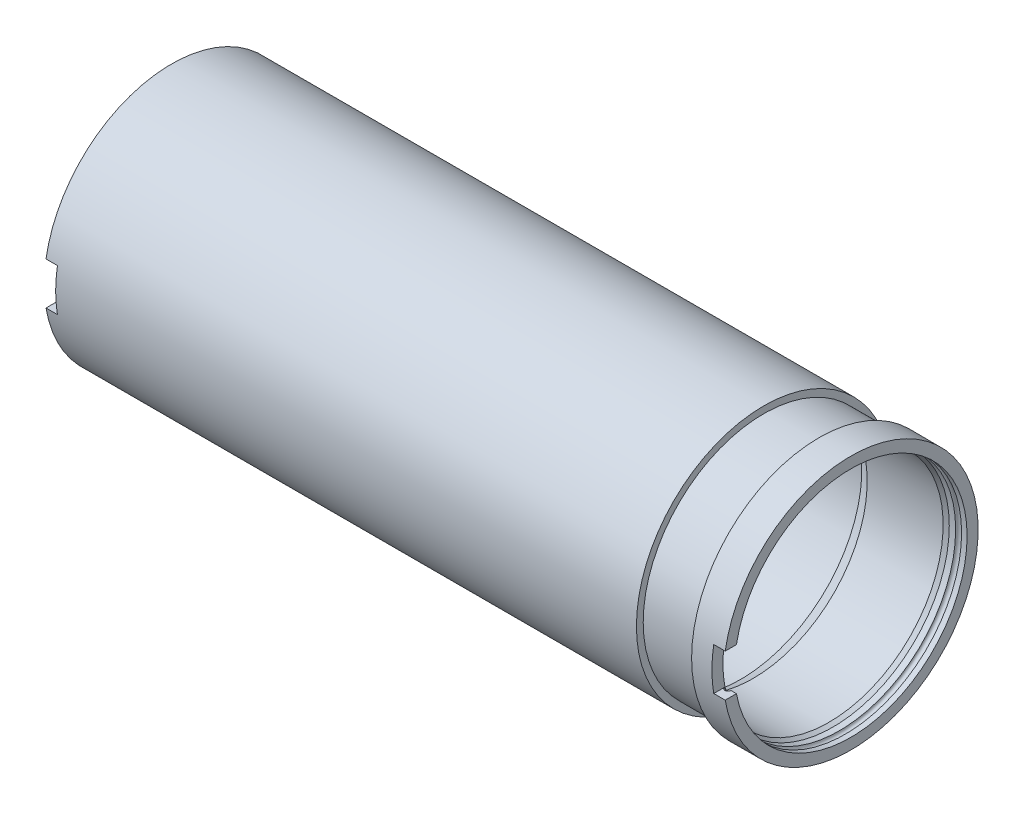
ISO-10303-21;
HEADER;
FILE_DESCRIPTION(('STEP AP214'),'2;1');
FILE_NAME('part.step','',(''),(''),'','','');
FILE_SCHEMA(('AUTOMOTIVE_DESIGN { 1 0 10303 214 1 1 1 1 }'));
ENDSEC;
DATA;
#1=APPLICATION_CONTEXT('core data for automotive mechanical design processes');
#2=APPLICATION_PROTOCOL_DEFINITION('international standard','automotive_design',2000,#1);
#3=PRODUCT_CONTEXT('',#1,'mechanical');
#4=PRODUCT('Part','Part','',(#3));
#5=PRODUCT_RELATED_PRODUCT_CATEGORY('part','',(#4));
#6=PRODUCT_DEFINITION_FORMATION('','',#4);
#7=PRODUCT_DEFINITION_CONTEXT('part definition',#1,'design');
#8=PRODUCT_DEFINITION('design','',#6,#7);
#9=PRODUCT_DEFINITION_SHAPE('','',#8);
#10=(LENGTH_UNIT() NAMED_UNIT(*) SI_UNIT(.MILLI.,.METRE.));
#11=(NAMED_UNIT(*) PLANE_ANGLE_UNIT() SI_UNIT($,.RADIAN.));
#12=(NAMED_UNIT(*) SI_UNIT($,.STERADIAN.) SOLID_ANGLE_UNIT());
#13=UNCERTAINTY_MEASURE_WITH_UNIT(LENGTH_MEASURE(1.E-05),#10,'distance_accuracy_value','');
#14=(GEOMETRIC_REPRESENTATION_CONTEXT(3) GLOBAL_UNCERTAINTY_ASSIGNED_CONTEXT((#13)) GLOBAL_UNIT_ASSIGNED_CONTEXT((#10,
#11,#12)) REPRESENTATION_CONTEXT('',''));
#15=CARTESIAN_POINT('',(0.,0.,0.));
#16=DIRECTION('',(0.,0.,1.));
#17=DIRECTION('',(1.,0.,0.));
#18=AXIS2_PLACEMENT_3D('',#15,#16,#17);
#19=CARTESIAN_POINT('',(200.66,0.,0.));
#20=DIRECTION('',(-1.,0.,0.));
#21=DIRECTION('',(0.,0.,1.));
#22=AXIS2_PLACEMENT_3D('',#19,#20,#21);
#23=TOROIDAL_SURFACE('',#22,34.798,0.888999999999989);
#24=CARTESIAN_POINT('',(201.549,0.,0.));
#25=DIRECTION('',(-1.,0.,0.));
#26=DIRECTION('',(0.,0.,1.));
#27=AXIS2_PLACEMENT_3D('',#24,#25,#26);
#28=CIRCLE('',#27,34.798);
#29=CARTESIAN_POINT('',(201.549,6.35000000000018,34.2137151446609));
#30=VERTEX_POINT('',#29);
#31=CARTESIAN_POINT('',(201.549,-6.35,34.2137151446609));
#32=VERTEX_POINT('',#31);
#33=EDGE_CURVE('E234',#30,#32,#28,.T.);
#34=ORIENTED_EDGE('',*,*,#33,.F.);
#35=CARTESIAN_POINT('',(200.306927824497,6.35,33.3835579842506));
#36=CARTESIAN_POINT('',(200.351930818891,6.35,33.363736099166));
#37=CARTESIAN_POINT('',(200.398627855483,6.35,33.347677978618));
#38=CARTESIAN_POINT('',(200.494090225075,6.35,33.3236136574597));
#39=CARTESIAN_POINT('',(200.542857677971,6.35,33.3156159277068));
#40=CARTESIAN_POINT('',(200.641035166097,6.35,33.3079444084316));
#41=CARTESIAN_POINT('',(200.690445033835,6.35,33.3082684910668));
#42=CARTESIAN_POINT('',(200.788492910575,6.35,33.3172269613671));
#43=CARTESIAN_POINT('',(200.837131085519,6.35,33.3258595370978));
#44=CARTESIAN_POINT('',(200.932183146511,6.35,33.3511371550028));
#45=CARTESIAN_POINT('',(200.978600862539,6.35,33.3677678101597));
#46=CARTESIAN_POINT('',(201.068019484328,6.35,33.4085241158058));
#47=CARTESIAN_POINT('',(201.111020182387,6.35,33.4326502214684));
#48=CARTESIAN_POINT('',(201.192779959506,6.35,33.4879030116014));
#49=CARTESIAN_POINT('',(201.231500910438,6.35,33.519086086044));
#50=CARTESIAN_POINT('',(201.303260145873,6.35,33.5874176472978));
#51=CARTESIAN_POINT('',(201.336298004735,6.35,33.6245665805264));
#52=CARTESIAN_POINT('',(201.396315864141,6.35,33.7044012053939));
#53=CARTESIAN_POINT('',(201.423191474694,6.35,33.7471653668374));
#54=CARTESIAN_POINT('',(201.469515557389,6.35,33.836542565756));
#55=CARTESIAN_POINT('',(201.488963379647,6.35,33.883155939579));
#56=CARTESIAN_POINT('',(201.520197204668,6.35,33.9797216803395));
#57=CARTESIAN_POINT('',(201.531853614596,6.35,34.029715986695));
#58=CARTESIAN_POINT('',(201.546696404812,6.35,34.1309474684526));
#59=CARTESIAN_POINT('',(201.549882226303,6.35,34.1821847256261));
#60=CARTESIAN_POINT('',(201.547688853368,6.35,34.2849669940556));
#61=CARTESIAN_POINT('',(201.542227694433,6.35,34.3365102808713));
#62=CARTESIAN_POINT('',(201.522721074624,6.35,34.4379480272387));
#63=CARTESIAN_POINT('',(201.508675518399,6.35,34.4878424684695));
#64=CARTESIAN_POINT('',(201.472381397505,6.35,34.5844894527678));
#65=CARTESIAN_POINT('',(201.450142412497,6.35,34.631245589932));
#66=CARTESIAN_POINT('',(201.398045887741,6.35,34.7203035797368));
#67=CARTESIAN_POINT('',(201.368188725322,6.35,34.7626056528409));
#68=CARTESIAN_POINT('',(201.302041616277,6.35,34.8410382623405));
#69=CARTESIAN_POINT('',(201.26582668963,6.35,34.8772320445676));
#70=CARTESIAN_POINT('',(201.187748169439,6.35,34.9429058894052));
#71=CARTESIAN_POINT('',(201.145885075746,6.35,34.9723865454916));
#72=CARTESIAN_POINT('',(201.058414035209,6.35,35.0232981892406));
#73=CARTESIAN_POINT('',(201.012876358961,6.35,35.0448499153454));
#74=CARTESIAN_POINT('',(200.918794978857,6.35,35.0798798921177));
#75=CARTESIAN_POINT('',(200.870251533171,6.35,35.0933588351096));
#76=CARTESIAN_POINT('',(200.772256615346,6.35,35.1116874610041));
#77=CARTESIAN_POINT('',(200.722826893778,6.35,35.1166535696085));
#78=CARTESIAN_POINT('',(200.623840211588,6.35,35.1181620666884));
#79=CARTESIAN_POINT('',(200.57428325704,6.35,35.1147048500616));
#80=CARTESIAN_POINT('',(200.476755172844,6.35,35.0995212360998));
#81=CARTESIAN_POINT('',(200.428776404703,6.35,35.0878438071));
#82=CARTESIAN_POINT('',(200.335448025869,6.35,35.056632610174));
#83=CARTESIAN_POINT('',(200.290098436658,6.35,35.0370987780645));
#84=CARTESIAN_POINT('',(200.203095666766,6.35,34.9906667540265));
#85=CARTESIAN_POINT('',(200.161458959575,6.35,34.9637377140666));
#86=CARTESIAN_POINT('',(200.083225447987,6.35,34.9033529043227));
#87=CARTESIAN_POINT('',(200.046628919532,6.35,34.869896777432));
#88=CARTESIAN_POINT('',(199.979013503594,6.35,34.7969677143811));
#89=CARTESIAN_POINT('',(199.948070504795,6.35,34.7574244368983));
#90=CARTESIAN_POINT('',(199.893139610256,6.35,34.6737718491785));
#91=CARTESIAN_POINT('',(199.869152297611,6.35,34.6296621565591));
#92=CARTESIAN_POINT('',(199.828415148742,6.35,34.537379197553));
#93=CARTESIAN_POINT('',(199.811786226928,6.35,34.4891525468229));
#94=CARTESIAN_POINT('',(199.786746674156,6.35,34.390610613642));
#95=CARTESIAN_POINT('',(199.778336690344,6.35,34.3402951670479));
#96=CARTESIAN_POINT('',(199.76988823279,6.35,34.2383203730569));
#97=CARTESIAN_POINT('',(199.769957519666,6.35,34.1866520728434));
#98=CARTESIAN_POINT('',(199.778731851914,6.35,34.0840542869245));
#99=CARTESIAN_POINT('',(199.78743691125,6.35,34.0331248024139));
#100=CARTESIAN_POINT('',(199.813307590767,6.35,33.9332529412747));
#101=CARTESIAN_POINT('',(199.83050520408,6.35,33.8843188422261));
#102=CARTESIAN_POINT('',(199.872934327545,6.35,33.7900486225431));
#103=CARTESIAN_POINT('',(199.898167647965,6.35,33.7447133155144));
#104=CARTESIAN_POINT('',(199.955793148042,6.35,33.6592899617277));
#105=CARTESIAN_POINT('',(199.988136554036,6.35,33.6191689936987));
#106=CARTESIAN_POINT('',(200.059174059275,6.35,33.5450727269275));
#107=CARTESIAN_POINT('',(200.097859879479,6.35,33.5110895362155));
#108=CARTESIAN_POINT('',(200.165232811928,6.35,33.4615080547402));
#109=CARTESIAN_POINT('',(200.192356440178,6.35,33.4437477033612));
#110=CARTESIAN_POINT('',(200.248384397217,6.35,33.4113000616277));
#111=CARTESIAN_POINT('',(200.277288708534,6.35,33.3966127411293));
#112=CARTESIAN_POINT('',(200.306927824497,6.35,33.3835579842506));
#113=B_SPLINE_CURVE_WITH_KNOTS('',3,(#35,#36,#37,#38,#39,#40,#41,#42,#43,#44,#45,#46,#47,#48,
#49,#50,#51,#52,#53,#54,#55,#56,#57,#58,#59,#60,#61,#62,#63,#64,#65,#66,#67,#68,#69,#70,#71,#72,
#73,#74,#75,#76,#77,#78,#79,#80,#81,#82,#83,#84,#85,#86,#87,#88,#89,#90,#91,#92,#93,#94,#95,#96,
#97,#98,#99,#100,#101,#102,#103,#104,#105,#106,#107,#108,#109,#110,#111,#112),.UNSPECIFIED.,.T.,
.F.,(4,2,2,2,2,2,2,2,2,2,2,2,2,2,2,2,2,2,2,2,2,2,2,2,2,2,2,2,2,2,2,2,2,2,2,2,2,2,4),(0.,
0.147407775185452,0.294970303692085,0.442495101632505,0.589987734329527,0.737216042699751,
0.88445329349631,1.03291143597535,1.18138069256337,1.33220471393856,1.48304192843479,
1.63632938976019,1.7896269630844,1.9443863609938,2.09914747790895,2.25372822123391,
2.4083013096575,2.56116000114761,2.71400517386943,2.86441577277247,3.01481347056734,
3.16313734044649,3.31145425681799,3.45889503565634,3.60633701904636,3.75440363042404,
3.90247834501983,4.05241425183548,4.20236272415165,4.35469114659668,4.50703156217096,
4.66130822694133,4.81558514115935,4.97044773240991,5.12534523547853,5.27921160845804,
5.4328787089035,5.52996289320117,5.62704612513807),.UNSPECIFIED.);
#114=CARTESIAN_POINT('',(199.771,6.35,34.2137151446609));
#115=VERTEX_POINT('',#114);
#116=EDGE_CURVE('E236',#30,#115,#113,.T.);
#117=ORIENTED_EDGE('',*,*,#116,.T.);
#118=CARTESIAN_POINT('',(199.771,0.,0.));
#119=DIRECTION('',(-1.,0.,0.));
#120=DIRECTION('',(0.,0.,1.));
#121=AXIS2_PLACEMENT_3D('',#118,#119,#120);
#122=CIRCLE('',#121,34.798);
#123=CARTESIAN_POINT('',(199.771,-6.35,34.2137151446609));
#124=VERTEX_POINT('',#123);
#125=EDGE_CURVE('E297',#115,#124,#122,.T.);
#126=ORIENTED_EDGE('',*,*,#125,.T.);
#127=CARTESIAN_POINT('',(200.306927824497,-6.35,33.3835579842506));
#128=CARTESIAN_POINT('',(200.26108380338,-6.35,33.4037553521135));
#129=CARTESIAN_POINT('',(200.216930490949,-6.35,33.4278891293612));
#130=CARTESIAN_POINT('',(200.133290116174,-6.35,33.4832810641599));
#131=CARTESIAN_POINT('',(200.093809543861,-6.35,33.5145489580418));
#132=CARTESIAN_POINT('',(200.020679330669,-6.35,33.5832090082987));
#133=CARTESIAN_POINT('',(199.987022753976,-6.35,33.6205937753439));
#134=CARTESIAN_POINT('',(199.926380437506,-6.35,33.7004092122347));
#135=CARTESIAN_POINT('',(199.899393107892,-6.35,33.7428386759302));
#136=CARTESIAN_POINT('',(199.852465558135,-6.35,33.8321179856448));
#137=CARTESIAN_POINT('',(199.83261885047,-6.35,33.8790169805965));
#138=CARTESIAN_POINT('',(199.800957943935,-6.35,33.9754546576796));
#139=CARTESIAN_POINT('',(199.789144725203,-6.35,34.0249936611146));
#140=CARTESIAN_POINT('',(199.773743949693,-6.35,34.1260342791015));
#141=CARTESIAN_POINT('',(199.770271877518,-6.35,34.1775535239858));
#142=CARTESIAN_POINT('',(199.771982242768,-6.35,34.2804496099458));
#143=CARTESIAN_POINT('',(199.777165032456,-6.35,34.3318264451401));
#144=CARTESIAN_POINT('',(199.796101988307,-6.35,34.4332213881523));
#145=CARTESIAN_POINT('',(199.809895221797,-6.35,34.4832322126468));
#146=CARTESIAN_POINT('',(199.845734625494,-6.35,34.5802058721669));
#147=CARTESIAN_POINT('',(199.867780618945,-6.35,34.6271687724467));
#148=CARTESIAN_POINT('',(199.919376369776,-6.35,34.7163764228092));
#149=CARTESIAN_POINT('',(199.948877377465,-6.35,34.758649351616));
#150=CARTESIAN_POINT('',(200.014652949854,-6.35,34.837550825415));
#151=CARTESIAN_POINT('',(200.050927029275,-6.35,34.8741797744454));
#152=CARTESIAN_POINT('',(200.128671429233,-6.35,34.9401868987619));
#153=CARTESIAN_POINT('',(200.170060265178,-6.35,34.9696610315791));
#154=CARTESIAN_POINT('',(200.257262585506,-6.35,35.021111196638));
#155=CARTESIAN_POINT('',(200.303075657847,-6.35,35.0430879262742));
#156=CARTESIAN_POINT('',(200.397048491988,-6.35,35.0785638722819));
#157=CARTESIAN_POINT('',(200.44515990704,-6.35,35.0921912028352));
#158=CARTESIAN_POINT('',(200.54299736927,-6.35,35.1110790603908));
#159=CARTESIAN_POINT('',(200.59272330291,-6.35,35.1163401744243));
#160=CARTESIAN_POINT('',(200.69182007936,-6.35,35.1183194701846));
#161=CARTESIAN_POINT('',(200.741189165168,-6.35,35.1151268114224));
#162=CARTESIAN_POINT('',(200.838686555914,-6.35,35.100487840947));
#163=CARTESIAN_POINT('',(200.886814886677,-6.35,35.089041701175));
#164=CARTESIAN_POINT('',(200.980424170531,-6.35,35.0582652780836));
#165=CARTESIAN_POINT('',(201.025907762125,-6.35,35.0389430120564));
#166=CARTESIAN_POINT('',(201.113024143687,-6.35,34.9930004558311));
#167=CARTESIAN_POINT('',(201.154656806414,-6.35,34.9663799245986));
#168=CARTESIAN_POINT('',(201.233292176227,-6.35,34.9063661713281));
#169=CARTESIAN_POINT('',(201.270251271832,-6.35,34.8729158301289));
#170=CARTESIAN_POINT('',(201.338130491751,-6.35,34.8003668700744));
#171=CARTESIAN_POINT('',(201.369050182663,-6.35,34.7612678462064));
#172=CARTESIAN_POINT('',(201.424468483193,-6.35,34.6779101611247));
#173=CARTESIAN_POINT('',(201.44886427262,-6.35,34.6335831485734));
#174=CARTESIAN_POINT('',(201.489995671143,-6.35,34.5415076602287));
#175=CARTESIAN_POINT('',(201.50673063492,-6.35,34.4937588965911));
#176=CARTESIAN_POINT('',(201.532317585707,-6.35,34.3954198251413));
#177=CARTESIAN_POINT('',(201.541046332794,-6.35,34.3447974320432));
#178=CARTESIAN_POINT('',(201.549965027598,-6.35,34.2428050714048));
#179=CARTESIAN_POINT('',(201.550154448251,-6.35,34.1914350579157));
#180=CARTESIAN_POINT('',(201.541955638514,-6.35,34.0889174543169));
#181=CARTESIAN_POINT('',(201.533490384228,-6.35,34.0377760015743));
#182=CARTESIAN_POINT('',(201.508083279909,-6.35,33.9376416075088));
#183=CARTESIAN_POINT('',(201.491141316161,-6.35,33.8886486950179));
#184=CARTESIAN_POINT('',(201.449253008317,-6.35,33.794295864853));
#185=CARTESIAN_POINT('',(201.42431838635,-6.35,33.7489307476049));
#186=CARTESIAN_POINT('',(201.36710048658,-6.35,33.6630964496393));
#187=CARTESIAN_POINT('',(201.334817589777,-6.35,33.622627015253));
#188=CARTESIAN_POINT('',(201.26421054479,-6.35,33.5482611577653));
#189=CARTESIAN_POINT('',(201.225962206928,-6.35,33.5142927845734));
#190=CARTESIAN_POINT('',(201.144222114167,-6.35,33.4533953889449));
#191=CARTESIAN_POINT('',(201.100731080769,-6.35,33.4264653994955));
#192=CARTESIAN_POINT('',(201.01054312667,-6.35,33.3808984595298));
#193=CARTESIAN_POINT('',(200.963914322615,-6.35,33.3621266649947));
#194=CARTESIAN_POINT('',(200.868125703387,-6.35,33.3328034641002));
#195=CARTESIAN_POINT('',(200.81896547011,-6.35,33.322253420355));
#196=CARTESIAN_POINT('',(200.720263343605,-6.35,33.3098072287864));
#197=CARTESIAN_POINT('',(200.670736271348,-6.35,33.3077927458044));
#198=CARTESIAN_POINT('',(200.572097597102,-6.35,33.3121619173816));
#199=CARTESIAN_POINT('',(200.522985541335,-6.35,33.3185347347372));
#200=CARTESIAN_POINT('',(200.445987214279,-6.35,33.3352264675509));
#201=CARTESIAN_POINT('',(200.417507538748,-6.35,33.3429278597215));
#202=CARTESIAN_POINT('',(200.361466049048,-6.35,33.3611511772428));
#203=CARTESIAN_POINT('',(200.333904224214,-6.35,33.3716730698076));
#204=CARTESIAN_POINT('',(200.306927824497,-6.35,33.3835579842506));
#205=B_SPLINE_CURVE_WITH_KNOTS('',3,(#127,#128,#129,#130,#131,#132,#133,#134,#135,#136,#137,
#138,#139,#140,#141,#142,#143,#144,#145,#146,#147,#148,#149,#150,#151,#152,#153,#154,#155,#156,
#157,#158,#159,#160,#161,#162,#163,#164,#165,#166,#167,#168,#169,#170,#171,#172,#173,#174,#175,
#176,#177,#178,#179,#180,#181,#182,#183,#184,#185,#186,#187,#188,#189,#190,#191,#192,#193,#194,
#195,#196,#197,#198,#199,#200,#201,#202,#203,#204),.UNSPECIFIED.,.T.,.F.,(4,2,2,2,2,2,2,2,2,2,2,
2,2,2,2,2,2,2,2,2,2,2,2,2,2,2,2,2,2,2,2,2,2,2,2,2,2,2,4),(0.,0.150178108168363,0.30056241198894,
0.450766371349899,0.600934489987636,0.753003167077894,0.90509039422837,1.05927145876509,
1.21345879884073,1.36835085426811,1.52323959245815,1.67714057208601,1.83103052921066,
1.9827257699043,2.1344068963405,2.28369816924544,2.43297896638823,2.58069162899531,
2.72840121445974,2.87596081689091,3.02352529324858,3.17237853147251,3.32124244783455,
3.47233014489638,3.62343056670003,3.77681965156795,3.93021820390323,4.08499394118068,
4.23977175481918,4.39432360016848,4.54886743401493,4.70158700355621,4.85428557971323,
5.00435420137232,5.15444768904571,5.30245336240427,5.45026798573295,5.5386396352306,
5.62701025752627),.UNSPECIFIED.);
#206=EDGE_CURVE('E128',#124,#32,#205,.T.);
#207=ORIENTED_EDGE('',*,*,#206,.T.);
#208=EDGE_LOOP('',(#34,#117,#126,#207));
#209=FACE_BOUND('',#208,.T.);
#210=ADVANCED_FACE('F39',(#209),#23,.F.);
#211=CARTESIAN_POINT('',(-166.103267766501,0.,0.));
#212=DIRECTION('',(-1.,0.,0.));
#213=DIRECTION('',(0.,0.,1.));
#214=AXIS2_PLACEMENT_3D('',#211,#212,#213);
#215=CYLINDRICAL_SURFACE('',#214,34.798);
#216=DIRECTION('',(-1.,0.,0.));
#217=VECTOR('',#216,1.);
#218=CARTESIAN_POINT('',(-166.103267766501,6.35000000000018,34.2137151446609));
#219=LINE('',#218,#217);
#220=CARTESIAN_POINT('',(203.2,6.35,34.2137151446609));
#221=VERTEX_POINT('',#220);
#222=EDGE_CURVE('E335',#30,#221,#219,.F.);
#223=ORIENTED_EDGE('',*,*,#222,.F.);
#224=ORIENTED_EDGE('',*,*,#33,.T.);
#225=DIRECTION('',(-1.,0.,0.));
#226=VECTOR('',#225,1.);
#227=CARTESIAN_POINT('',(-166.103267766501,-6.35,34.2137151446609));
#228=LINE('',#227,#226);
#229=CARTESIAN_POINT('',(203.2,-6.35,34.2137151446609));
#230=VERTEX_POINT('',#229);
#231=EDGE_CURVE('E121',#230,#32,#228,.T.);
#232=ORIENTED_EDGE('',*,*,#231,.F.);
#233=CARTESIAN_POINT('',(203.2,0.,0.));
#234=DIRECTION('',(-1.,0.,0.));
#235=DIRECTION('',(0.,0.,1.));
#236=AXIS2_PLACEMENT_3D('',#233,#234,#235);
#237=CIRCLE('',#236,34.798);
#238=EDGE_CURVE('E241',#221,#230,#237,.T.);
#239=ORIENTED_EDGE('',*,*,#238,.F.);
#240=EDGE_LOOP('',(#223,#224,#232,#239));
#241=FACE_BOUND('',#240,.T.);
#242=ADVANCED_FACE('F180',(#241),#215,.F.);
#243=CARTESIAN_POINT('',(203.2,0.,0.));
#244=DIRECTION('',(-1.,0.,0.));
#245=DIRECTION('',(0.,0.,1.));
#246=AXIS2_PLACEMENT_3D('',#243,#244,#245);
#247=PLANE('',#246);
#248=DIRECTION('',(0.,0.,-1.));
#249=VECTOR('',#248,1.);
#250=CARTESIAN_POINT('',(203.2,6.35,38.1));
#251=LINE('',#250,#249);
#252=CARTESIAN_POINT('',(203.2,6.35,37.5671066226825));
#253=VERTEX_POINT('',#252);
#254=EDGE_CURVE('E122',#253,#221,#251,.T.);
#255=ORIENTED_EDGE('',*,*,#254,.T.);
#256=ORIENTED_EDGE('',*,*,#238,.T.);
#257=DIRECTION('',(0.,0.,-1.));
#258=VECTOR('',#257,1.);
#259=CARTESIAN_POINT('',(203.2,-6.35,38.1));
#260=LINE('',#259,#258);
#261=CARTESIAN_POINT('',(203.2,-6.35,37.5671066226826));
#262=VERTEX_POINT('',#261);
#263=EDGE_CURVE('E130',#262,#230,#260,.T.);
#264=ORIENTED_EDGE('',*,*,#263,.F.);
#265=CARTESIAN_POINT('',(203.2,0.,0.));
#266=DIRECTION('',(-1.,0.,0.));
#267=DIRECTION('',(0.,0.,1.));
#268=AXIS2_PLACEMENT_3D('',#265,#266,#267);
#269=CIRCLE('',#268,38.1);
#270=EDGE_CURVE('E135',#253,#262,#269,.T.);
#271=ORIENTED_EDGE('',*,*,#270,.F.);
#272=EDGE_LOOP('',(#255,#256,#264,#271));
#273=FACE_BOUND('',#272,.T.);
#274=ADVANCED_FACE('F229',(#273),#247,.F.);
#275=CARTESIAN_POINT('',(-166.103267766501,0.,0.));
#276=DIRECTION('',(-1.,0.,0.));
#277=DIRECTION('',(0.,0.,1.));
#278=AXIS2_PLACEMENT_3D('',#275,#276,#277);
#279=CYLINDRICAL_SURFACE('',#278,38.1);
#280=CARTESIAN_POINT('',(193.675,0.,0.));
#281=DIRECTION('',(-1.,0.,0.));
#282=DIRECTION('',(0.,0.,1.));
#283=AXIS2_PLACEMENT_3D('',#280,#281,#282);
#284=CIRCLE('',#283,38.1);
#285=CARTESIAN_POINT('',(193.675,0.,38.1));
#286=VERTEX_POINT('',#285);
#287=EDGE_CURVE('E248',#286,#286,#284,.T.);
#288=ORIENTED_EDGE('',*,*,#287,.F.);
#289=EDGE_LOOP('',(#288));
#290=FACE_BOUND('',#289,.T.);
#291=DIRECTION('',(-1.,0.,0.));
#292=VECTOR('',#291,1.);
#293=CARTESIAN_POINT('',(-166.103267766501,6.35000000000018,37.5671066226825));
#294=LINE('',#293,#292);
#295=CARTESIAN_POINT('',(199.771,6.35,37.5671066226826));
#296=VERTEX_POINT('',#295);
#297=EDGE_CURVE('E11',#253,#296,#294,.T.);
#298=ORIENTED_EDGE('',*,*,#297,.F.);
#299=ORIENTED_EDGE('',*,*,#270,.T.);
#300=DIRECTION('',(-1.,0.,0.));
#301=VECTOR('',#300,1.);
#302=CARTESIAN_POINT('',(-166.103267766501,-6.35,37.5671066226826));
#303=LINE('',#302,#301);
#304=CARTESIAN_POINT('',(199.771,-6.35,37.5671066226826));
#305=VERTEX_POINT('',#304);
#306=EDGE_CURVE('E47',#305,#262,#303,.F.);
#307=ORIENTED_EDGE('',*,*,#306,.F.);
#308=CARTESIAN_POINT('',(199.771,0.,0.));
#309=DIRECTION('',(1.,0.,0.));
#310=DIRECTION('',(0.,0.,-1.));
#311=AXIS2_PLACEMENT_3D('',#308,#309,#310);
#312=CIRCLE('',#311,38.1);
#313=EDGE_CURVE('E114',#296,#305,#312,.T.);
#314=ORIENTED_EDGE('',*,*,#313,.F.);
#315=EDGE_LOOP('',(#298,#299,#307,#314));
#316=FACE_BOUND('',#315,.T.);
#317=ADVANCED_FACE('F133',(#290,#316),#279,.T.);
#318=CARTESIAN_POINT('',(-166.103267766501,0.,0.));
#319=DIRECTION('',(-1.,0.,0.));
#320=DIRECTION('',(0.,0.,1.));
#321=AXIS2_PLACEMENT_3D('',#318,#319,#320);
#322=CYLINDRICAL_SURFACE('',#321,38.1);
#323=CARTESIAN_POINT('',(177.165,0.,0.));
#324=DIRECTION('',(-1.,0.,0.));
#325=DIRECTION('',(0.,0.,1.));
#326=AXIS2_PLACEMENT_3D('',#323,#324,#325);
#327=CIRCLE('',#326,38.1);
#328=CARTESIAN_POINT('',(177.165,0.,38.1));
#329=VERTEX_POINT('',#328);
#330=EDGE_CURVE('E257',#329,#329,#327,.T.);
#331=ORIENTED_EDGE('',*,*,#330,.T.);
#332=EDGE_LOOP('',(#331));
#333=FACE_BOUND('',#332,.T.);
#334=CARTESIAN_POINT('',(3.42899999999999,0.,0.));
#335=DIRECTION('',(-1.,0.,0.));
#336=DIRECTION('',(0.,0.,1.));
#337=AXIS2_PLACEMENT_3D('',#334,#335,#336);
#338=CIRCLE('',#337,38.1);
#339=CARTESIAN_POINT('',(3.42899999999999,6.35,37.5671066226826));
#340=VERTEX_POINT('',#339);
#341=CARTESIAN_POINT('',(3.42899999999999,-6.35,37.5671066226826));
#342=VERTEX_POINT('',#341);
#343=EDGE_CURVE('E319',#340,#342,#338,.F.);
#344=ORIENTED_EDGE('',*,*,#343,.T.);
#345=DIRECTION('',(-1.,0.,0.));
#346=VECTOR('',#345,1.);
#347=CARTESIAN_POINT('',(-166.103267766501,-6.35,37.5671066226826));
#348=LINE('',#347,#346);
#349=CARTESIAN_POINT('',(0.,-6.35,37.5671066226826));
#350=VERTEX_POINT('',#349);
#351=EDGE_CURVE('E309',#342,#350,#348,.T.);
#352=ORIENTED_EDGE('',*,*,#351,.T.);
#353=CARTESIAN_POINT('',(0.,0.,0.));
#354=DIRECTION('',(-1.,0.,0.));
#355=DIRECTION('',(0.,0.,1.));
#356=AXIS2_PLACEMENT_3D('',#353,#354,#355);
#357=CIRCLE('',#356,38.1);
#358=CARTESIAN_POINT('',(0.,6.35,37.5671066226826));
#359=VERTEX_POINT('',#358);
#360=EDGE_CURVE('E260',#359,#350,#357,.T.);
#361=ORIENTED_EDGE('',*,*,#360,.F.);
#362=DIRECTION('',(-1.,0.,0.));
#363=VECTOR('',#362,1.);
#364=CARTESIAN_POINT('',(-166.103267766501,6.35,37.5671066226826));
#365=LINE('',#364,#363);
#366=EDGE_CURVE('E314',#359,#340,#365,.F.);
#367=ORIENTED_EDGE('',*,*,#366,.T.);
#368=EDGE_LOOP('',(#344,#352,#361,#367));
#369=FACE_BOUND('',#368,.T.);
#370=ADVANCED_FACE('F360',(#333,#369),#322,.T.);
#371=CARTESIAN_POINT('',(0.,0.,0.));
#372=DIRECTION('',(1.,0.,0.));
#373=DIRECTION('',(0.,0.,-1.));
#374=AXIS2_PLACEMENT_3D('',#371,#372,#373);
#375=PLANE('',#374);
#376=DIRECTION('',(0.,0.,-1.));
#377=VECTOR('',#376,1.);
#378=CARTESIAN_POINT('',(0.,-6.35,38.1));
#379=LINE('',#378,#377);
#380=CARTESIAN_POINT('',(0.,-6.35,34.2137151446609));
#381=VERTEX_POINT('',#380);
#382=EDGE_CURVE('E321',#350,#381,#379,.T.);
#383=ORIENTED_EDGE('',*,*,#382,.T.);
#384=CARTESIAN_POINT('',(0.,0.,0.));
#385=DIRECTION('',(-1.,0.,0.));
#386=DIRECTION('',(0.,0.,1.));
#387=AXIS2_PLACEMENT_3D('',#384,#385,#386);
#388=CIRCLE('',#387,34.798);
#389=CARTESIAN_POINT('',(0.,6.35,34.2137151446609));
#390=VERTEX_POINT('',#389);
#391=EDGE_CURVE('E263',#390,#381,#388,.T.);
#392=ORIENTED_EDGE('',*,*,#391,.F.);
#393=DIRECTION('',(0.,0.,-1.));
#394=VECTOR('',#393,1.);
#395=CARTESIAN_POINT('',(0.,6.35,38.1));
#396=LINE('',#395,#394);
#397=EDGE_CURVE('E328',#359,#390,#396,.T.);
#398=ORIENTED_EDGE('',*,*,#397,.F.);
#399=ORIENTED_EDGE('',*,*,#360,.T.);
#400=EDGE_LOOP('',(#383,#392,#398,#399));
#401=FACE_BOUND('',#400,.T.);
#402=ADVANCED_FACE('F222',(#401),#375,.F.);
#403=CARTESIAN_POINT('',(-166.103267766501,0.,0.));
#404=DIRECTION('',(-1.,0.,0.));
#405=DIRECTION('',(0.,0.,1.));
#406=AXIS2_PLACEMENT_3D('',#403,#404,#405);
#407=CYLINDRICAL_SURFACE('',#406,34.798);
#408=DIRECTION('',(-1.,0.,0.));
#409=VECTOR('',#408,1.);
#410=CARTESIAN_POINT('',(-166.103267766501,-6.35,34.2137151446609));
#411=LINE('',#410,#409);
#412=CARTESIAN_POINT('',(1.651,-6.35,34.2137151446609));
#413=VERTEX_POINT('',#412);
#414=EDGE_CURVE('E312',#413,#381,#411,.T.);
#415=ORIENTED_EDGE('',*,*,#414,.F.);
#416=CARTESIAN_POINT('',(1.65100000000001,0.,0.));
#417=DIRECTION('',(-1.,0.,0.));
#418=DIRECTION('',(0.,0.,1.));
#419=AXIS2_PLACEMENT_3D('',#416,#417,#418);
#420=CIRCLE('',#419,34.798);
#421=CARTESIAN_POINT('',(1.65099999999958,6.35,34.213715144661));
#422=VERTEX_POINT('',#421);
#423=EDGE_CURVE('E266',#422,#413,#420,.T.);
#424=ORIENTED_EDGE('',*,*,#423,.F.);
#425=DIRECTION('',(-1.,0.,0.));
#426=VECTOR('',#425,1.);
#427=CARTESIAN_POINT('',(-166.103267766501,6.35,34.2137151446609));
#428=LINE('',#427,#426);
#429=EDGE_CURVE('E317',#390,#422,#428,.F.);
#430=ORIENTED_EDGE('',*,*,#429,.F.);
#431=ORIENTED_EDGE('',*,*,#391,.T.);
#432=EDGE_LOOP('',(#415,#424,#430,#431));
#433=FACE_BOUND('',#432,.T.);
#434=ADVANCED_FACE('F212',(#433),#407,.F.);
#435=CARTESIAN_POINT('',(2.54,0.,0.));
#436=DIRECTION('',(-1.,0.,0.));
#437=DIRECTION('',(0.,0.,1.));
#438=AXIS2_PLACEMENT_3D('',#435,#436,#437);
#439=TOROIDAL_SURFACE('',#438,34.798,0.888999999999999);
#440=ORIENTED_EDGE('',*,*,#423,.T.);
#441=CARTESIAN_POINT('',(2.18692782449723,-6.35,33.3835579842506));
#442=CARTESIAN_POINT('',(2.14108380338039,-6.35,33.4037553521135));
#443=CARTESIAN_POINT('',(2.09693049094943,-6.35,33.4278891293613));
#444=CARTESIAN_POINT('',(2.0132901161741,-6.35,33.4832810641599));
#445=CARTESIAN_POINT('',(1.97380954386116,-6.35,33.5145489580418));
#446=CARTESIAN_POINT('',(1.90067933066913,-6.35,33.5832090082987));
#447=CARTESIAN_POINT('',(1.86702275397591,-6.35,33.6205937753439));
#448=CARTESIAN_POINT('',(1.80638043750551,-6.35,33.7004092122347));
#449=CARTESIAN_POINT('',(1.77939310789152,-6.35,33.7428386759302));
#450=CARTESIAN_POINT('',(1.73246555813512,-6.35,33.8321179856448));
#451=CARTESIAN_POINT('',(1.71261885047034,-6.35,33.8790169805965));
#452=CARTESIAN_POINT('',(1.68095794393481,-6.35,33.9754546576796));
#453=CARTESIAN_POINT('',(1.66914472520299,-6.35,34.0249936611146));
#454=CARTESIAN_POINT('',(1.65374394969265,-6.35,34.1260342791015));
#455=CARTESIAN_POINT('',(1.65027187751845,-6.35,34.1775535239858));
#456=CARTESIAN_POINT('',(1.65198224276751,-6.35,34.2804496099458));
#457=CARTESIAN_POINT('',(1.65716503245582,-6.35,34.3318264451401));
#458=CARTESIAN_POINT('',(1.67610198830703,-6.35,34.4332213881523));
#459=CARTESIAN_POINT('',(1.68989522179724,-6.35,34.4832322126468));
#460=CARTESIAN_POINT('',(1.72573462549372,-6.35,34.5802058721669));
#461=CARTESIAN_POINT('',(1.74778061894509,-6.35,34.6271687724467));
#462=CARTESIAN_POINT('',(1.7993763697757,-6.35,34.7163764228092));
#463=CARTESIAN_POINT('',(1.82887737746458,-6.35,34.758649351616));
#464=CARTESIAN_POINT('',(1.89465294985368,-6.35,34.837550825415));
#465=CARTESIAN_POINT('',(1.93092702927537,-6.35,34.8741797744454));
#466=CARTESIAN_POINT('',(2.00867142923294,-6.35,34.940186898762));
#467=CARTESIAN_POINT('',(2.05006026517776,-6.35,34.9696610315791));
#468=CARTESIAN_POINT('',(2.13726258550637,-6.35,35.0211111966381));
#469=CARTESIAN_POINT('',(2.18307565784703,-6.35,35.0430879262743));
#470=CARTESIAN_POINT('',(2.27704849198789,-6.35,35.0785638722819));
#471=CARTESIAN_POINT('',(2.32515990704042,-6.35,35.0921912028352));
#472=CARTESIAN_POINT('',(2.42299736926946,-6.35,35.1110790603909));
#473=CARTESIAN_POINT('',(2.47272330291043,-6.35,35.1163401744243));
#474=CARTESIAN_POINT('',(2.57182007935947,-6.35,35.1183194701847));
#475=CARTESIAN_POINT('',(2.62118916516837,-6.35,35.1151268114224));
#476=CARTESIAN_POINT('',(2.71868655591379,-6.35,35.1004878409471));
#477=CARTESIAN_POINT('',(2.76681488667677,-6.35,35.089041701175));
#478=CARTESIAN_POINT('',(2.86042417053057,-6.35,35.0582652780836));
#479=CARTESIAN_POINT('',(2.90590776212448,-6.35,35.0389430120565));
#480=CARTESIAN_POINT('',(2.99302414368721,-6.35,34.9930004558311));
#481=CARTESIAN_POINT('',(3.03465680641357,-6.35,34.9663799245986));
#482=CARTESIAN_POINT('',(3.11329217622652,-6.35,34.9063661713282));
#483=CARTESIAN_POINT('',(3.15025127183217,-6.35,34.8729158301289));
#484=CARTESIAN_POINT('',(3.21813049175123,-6.35,34.8003668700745));
#485=CARTESIAN_POINT('',(3.24905018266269,-6.35,34.7612678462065));
#486=CARTESIAN_POINT('',(3.30446848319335,-6.35,34.6779101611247));
#487=CARTESIAN_POINT('',(3.32886427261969,-6.35,34.6335831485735));
#488=CARTESIAN_POINT('',(3.3699956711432,-6.35,34.5415076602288));
#489=CARTESIAN_POINT('',(3.38673063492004,-6.35,34.4937588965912));
#490=CARTESIAN_POINT('',(3.41231758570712,-6.35,34.3954198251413));
#491=CARTESIAN_POINT('',(3.42104633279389,-6.35,34.3447974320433));
#492=CARTESIAN_POINT('',(3.42996502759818,-6.35,34.2428050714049));
#493=CARTESIAN_POINT('',(3.43015444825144,-6.35,34.1914350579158));
#494=CARTESIAN_POINT('',(3.42195563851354,-6.35,34.088917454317));
#495=CARTESIAN_POINT('',(3.41349038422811,-6.35,34.0377760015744));
#496=CARTESIAN_POINT('',(3.38808327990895,-6.35,33.9376416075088));
#497=CARTESIAN_POINT('',(3.37114131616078,-6.35,33.8886486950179));
#498=CARTESIAN_POINT('',(3.32925300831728,-6.35,33.794295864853));
#499=CARTESIAN_POINT('',(3.30431838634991,-6.35,33.7489307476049));
#500=CARTESIAN_POINT('',(3.2471004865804,-6.35,33.6630964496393));
#501=CARTESIAN_POINT('',(3.21481758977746,-6.35,33.6226270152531));
#502=CARTESIAN_POINT('',(3.14421054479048,-6.35,33.5482611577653));
#503=CARTESIAN_POINT('',(3.10596220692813,-6.35,33.5142927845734));
#504=CARTESIAN_POINT('',(3.02422211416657,-6.35,33.4533953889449));
#505=CARTESIAN_POINT('',(2.98073108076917,-6.35,33.4264653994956));
#506=CARTESIAN_POINT('',(2.89054312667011,-6.35,33.3808984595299));
#507=CARTESIAN_POINT('',(2.84391432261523,-6.35,33.3621266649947));
#508=CARTESIAN_POINT('',(2.74812570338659,-6.35,33.3328034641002));
#509=CARTESIAN_POINT('',(2.69896547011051,-6.35,33.3222534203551));
#510=CARTESIAN_POINT('',(2.60026334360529,-6.35,33.3098072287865));
#511=CARTESIAN_POINT('',(2.55073627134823,-6.35,33.3077927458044));
#512=CARTESIAN_POINT('',(2.45209759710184,-6.35,33.3121619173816));
#513=CARTESIAN_POINT('',(2.40298554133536,-6.35,33.3185347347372));
#514=CARTESIAN_POINT('',(2.32598721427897,-6.35,33.335226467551));
#515=CARTESIAN_POINT('',(2.29750753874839,-6.35,33.3429278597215));
#516=CARTESIAN_POINT('',(2.24146604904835,-6.35,33.3611511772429));
#517=CARTESIAN_POINT('',(2.21390422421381,-6.35,33.3716730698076));
#518=CARTESIAN_POINT('',(2.18692782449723,-6.35,33.3835579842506));
#519=B_SPLINE_CURVE_WITH_KNOTS('',3,(#441,#442,#443,#444,#445,#446,#447,#448,#449,#450,#451,
#452,#453,#454,#455,#456,#457,#458,#459,#460,#461,#462,#463,#464,#465,#466,#467,#468,#469,#470,
#471,#472,#473,#474,#475,#476,#477,#478,#479,#480,#481,#482,#483,#484,#485,#486,#487,#488,#489,
#490,#491,#492,#493,#494,#495,#496,#497,#498,#499,#500,#501,#502,#503,#504,#505,#506,#507,#508,
#509,#510,#511,#512,#513,#514,#515,#516,#517,#518),.UNSPECIFIED.,.T.,.F.,(4,2,2,2,2,2,2,2,2,2,2,
2,2,2,2,2,2,2,2,2,2,2,2,2,2,2,2,2,2,2,2,2,2,2,2,2,2,2,4),(0.,0.150178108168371,
0.300562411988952,0.450766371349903,0.600934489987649,0.753003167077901,0.905090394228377,
1.0592714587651,1.21345879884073,1.3683508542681,1.52323959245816,1.67714057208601,
1.83103052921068,1.98272576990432,2.13440689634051,2.28369816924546,2.43297896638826,
2.58069162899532,2.72840121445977,2.87596081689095,3.02352529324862,3.17237853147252,
3.32124244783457,3.47233014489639,3.62343056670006,3.77681965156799,3.93021820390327,
4.08499394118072,4.23977175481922,4.39432360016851,4.54886743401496,4.70158700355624,
4.85428557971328,5.00435420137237,5.15444768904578,5.30245336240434,5.45026798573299,
5.53863963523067,5.62701025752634),.UNSPECIFIED.);
#520=CARTESIAN_POINT('',(3.42899999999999,-6.35,34.2137151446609));
#521=VERTEX_POINT('',#520);
#522=EDGE_CURVE('E136',#413,#521,#519,.T.);
#523=ORIENTED_EDGE('',*,*,#522,.T.);
#524=CARTESIAN_POINT('',(3.42899999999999,0.,0.));
#525=DIRECTION('',(-1.,0.,0.));
#526=DIRECTION('',(0.,0.,1.));
#527=AXIS2_PLACEMENT_3D('',#524,#525,#526);
#528=CIRCLE('',#527,34.798);
#529=CARTESIAN_POINT('',(3.42899999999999,6.35,34.2137151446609));
#530=VERTEX_POINT('',#529);
#531=EDGE_CURVE('E269',#530,#521,#528,.T.);
#532=ORIENTED_EDGE('',*,*,#531,.F.);
#533=CARTESIAN_POINT('',(2.18692782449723,6.35,33.3835579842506));
#534=CARTESIAN_POINT('',(2.23193081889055,6.35,33.3637360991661));
#535=CARTESIAN_POINT('',(2.27862785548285,6.35,33.347677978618));
#536=CARTESIAN_POINT('',(2.37409022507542,6.35,33.3236136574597));
#537=CARTESIAN_POINT('',(2.42285767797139,6.35,33.3156159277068));
#538=CARTESIAN_POINT('',(2.52103516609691,6.35,33.3079444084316));
#539=CARTESIAN_POINT('',(2.57044503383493,6.35,33.3082684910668));
#540=CARTESIAN_POINT('',(2.66849291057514,6.35,33.3172269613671));
#541=CARTESIAN_POINT('',(2.71713108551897,6.35,33.3258595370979));
#542=CARTESIAN_POINT('',(2.81218314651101,6.35,33.3511371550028));
#543=CARTESIAN_POINT('',(2.85860086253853,6.35,33.3677678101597));
#544=CARTESIAN_POINT('',(2.94801948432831,6.35,33.4085241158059));
#545=CARTESIAN_POINT('',(2.99102018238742,6.35,33.4326502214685));
#546=CARTESIAN_POINT('',(3.07277995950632,6.35,33.4879030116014));
#547=CARTESIAN_POINT('',(3.11150091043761,6.35,33.5190860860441));
#548=CARTESIAN_POINT('',(3.18326014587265,6.35,33.5874176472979));
#549=CARTESIAN_POINT('',(3.2162980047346,6.35,33.6245665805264));
#550=CARTESIAN_POINT('',(3.2763158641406,6.35,33.7044012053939));
#551=CARTESIAN_POINT('',(3.30319147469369,6.35,33.7471653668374));
#552=CARTESIAN_POINT('',(3.34951555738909,6.35,33.8365425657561));
#553=CARTESIAN_POINT('',(3.36896337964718,6.35,33.8831559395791));
#554=CARTESIAN_POINT('',(3.40019720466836,6.35,33.9797216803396));
#555=CARTESIAN_POINT('',(3.41185361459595,6.35,34.0297159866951));
#556=CARTESIAN_POINT('',(3.42669640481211,6.35,34.1309474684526));
#557=CARTESIAN_POINT('',(3.42988222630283,6.35,34.1821847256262));
#558=CARTESIAN_POINT('',(3.42768885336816,6.35,34.2849669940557));
#559=CARTESIAN_POINT('',(3.42222769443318,6.35,34.3365102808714));
#560=CARTESIAN_POINT('',(3.40272107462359,6.35,34.4379480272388));
#561=CARTESIAN_POINT('',(3.38867551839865,6.35,34.4878424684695));
#562=CARTESIAN_POINT('',(3.35238139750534,6.35,34.5844894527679));
#563=CARTESIAN_POINT('',(3.3301424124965,6.35,34.631245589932));
#564=CARTESIAN_POINT('',(3.27804588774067,6.35,34.7203035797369));
#565=CARTESIAN_POINT('',(3.24818872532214,6.35,34.7626056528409));
#566=CARTESIAN_POINT('',(3.18204161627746,6.35,34.8410382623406));
#567=CARTESIAN_POINT('',(3.1458266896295,6.35,34.8772320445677));
#568=CARTESIAN_POINT('',(3.06774816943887,6.35,34.9429058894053));
#569=CARTESIAN_POINT('',(3.02588507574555,6.35,34.9723865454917));
#570=CARTESIAN_POINT('',(2.93841403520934,6.35,35.0232981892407));
#571=CARTESIAN_POINT('',(2.89287635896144,6.35,35.0448499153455));
#572=CARTESIAN_POINT('',(2.7987949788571,6.35,35.0798798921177));
#573=CARTESIAN_POINT('',(2.75025153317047,6.35,35.0933588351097));
#574=CARTESIAN_POINT('',(2.65225661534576,6.35,35.1116874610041));
#575=CARTESIAN_POINT('',(2.60282689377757,6.35,35.1166535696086));
#576=CARTESIAN_POINT('',(2.50384021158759,6.35,35.1181620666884));
#577=CARTESIAN_POINT('',(2.45428325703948,6.35,35.1147048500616));
#578=CARTESIAN_POINT('',(2.35675517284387,6.35,35.0995212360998));
#579=CARTESIAN_POINT('',(2.30877640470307,6.35,35.0878438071));
#580=CARTESIAN_POINT('',(2.21544802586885,6.35,35.0566326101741));
#581=CARTESIAN_POINT('',(2.17009843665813,6.35,35.0370987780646));
#582=CARTESIAN_POINT('',(2.0830956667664,6.35,34.9906667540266));
#583=CARTESIAN_POINT('',(2.0414589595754,6.35,34.9637377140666));
#584=CARTESIAN_POINT('',(1.96322544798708,6.35,34.9033529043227));
#585=CARTESIAN_POINT('',(1.92662891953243,6.35,34.8698967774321));
#586=CARTESIAN_POINT('',(1.85901350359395,6.35,34.7969677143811));
#587=CARTESIAN_POINT('',(1.82807050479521,6.35,34.7574244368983));
#588=CARTESIAN_POINT('',(1.77313961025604,6.35,34.6737718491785));
#589=CARTESIAN_POINT('',(1.74915229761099,6.35,34.6296621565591));
#590=CARTESIAN_POINT('',(1.70841514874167,6.35,34.537379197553));
#591=CARTESIAN_POINT('',(1.69178622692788,6.35,34.4891525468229));
#592=CARTESIAN_POINT('',(1.66674667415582,6.35,34.390610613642));
#593=CARTESIAN_POINT('',(1.65833669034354,6.35,34.3402951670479));
#594=CARTESIAN_POINT('',(1.64988823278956,6.35,34.2383203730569));
#595=CARTESIAN_POINT('',(1.64995751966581,6.35,34.1866520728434));
#596=CARTESIAN_POINT('',(1.65873185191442,6.35,34.0840542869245));
#597=CARTESIAN_POINT('',(1.66743691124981,6.35,34.0331248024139));
#598=CARTESIAN_POINT('',(1.69330759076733,6.35,33.9332529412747));
#599=CARTESIAN_POINT('',(1.71050520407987,6.35,33.8843188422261));
#600=CARTESIAN_POINT('',(1.75293432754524,6.35,33.7900486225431));
#601=CARTESIAN_POINT('',(1.77816764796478,6.35,33.7447133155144));
#602=CARTESIAN_POINT('',(1.83579314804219,6.35,33.6592899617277));
#603=CARTESIAN_POINT('',(1.86813655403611,6.35,33.6191689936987));
#604=CARTESIAN_POINT('',(1.93917405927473,6.35,33.5450727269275));
#605=CARTESIAN_POINT('',(1.97785987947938,6.35,33.5110895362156));
#606=CARTESIAN_POINT('',(2.04523281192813,6.35,33.4615080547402));
#607=CARTESIAN_POINT('',(2.07235644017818,6.35,33.4437477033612));
#608=CARTESIAN_POINT('',(2.12838439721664,6.35,33.4113000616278));
#609=CARTESIAN_POINT('',(2.15728870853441,6.35,33.3966127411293));
#610=CARTESIAN_POINT('',(2.18692782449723,6.35,33.3835579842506));
#611=B_SPLINE_CURVE_WITH_KNOTS('',3,(#533,#534,#535,#536,#537,#538,#539,#540,#541,#542,#543,
#544,#545,#546,#547,#548,#549,#550,#551,#552,#553,#554,#555,#556,#557,#558,#559,#560,#561,#562,
#563,#564,#565,#566,#567,#568,#569,#570,#571,#572,#573,#574,#575,#576,#577,#578,#579,#580,#581,
#582,#583,#584,#585,#586,#587,#588,#589,#590,#591,#592,#593,#594,#595,#596,#597,#598,#599,#600,
#601,#602,#603,#604,#605,#606,#607,#608,#609,#610),.UNSPECIFIED.,.T.,.F.,(4,2,2,2,2,2,2,2,2,2,2,
2,2,2,2,2,2,2,2,2,2,2,2,2,2,2,2,2,2,2,2,2,2,2,2,2,2,2,4),(0.,0.147407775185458,
0.294970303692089,0.442495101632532,0.58998773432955,0.737216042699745,0.884453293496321,
1.03291143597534,1.18138069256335,1.33220471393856,1.48304192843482,1.63632938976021,
1.78962696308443,1.94438636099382,2.09914747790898,2.25372822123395,2.40830130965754,
2.56116000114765,2.71400517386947,2.86441577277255,3.01481347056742,3.16313734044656,
3.31145425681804,3.45889503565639,3.60633701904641,3.75440363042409,3.90247834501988,
4.05241425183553,4.2023627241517,4.35469114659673,4.50703156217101,4.66130822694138,
4.81558514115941,4.97044773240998,5.12534523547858,5.2792116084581,5.43287870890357,
5.52996289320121,5.62704612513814),.UNSPECIFIED.);
#612=EDGE_CURVE('E138',#530,#422,#611,.T.);
#613=ORIENTED_EDGE('',*,*,#612,.T.);
#614=EDGE_LOOP('',(#440,#523,#532,#613));
#615=FACE_BOUND('',#614,.T.);
#616=ADVANCED_FACE('F151',(#615),#439,.F.);
#617=CARTESIAN_POINT('',(-166.103267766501,0.,0.));
#618=DIRECTION('',(-1.,0.,0.));
#619=DIRECTION('',(0.,0.,1.));
#620=AXIS2_PLACEMENT_3D('',#617,#618,#619);
#621=CYLINDRICAL_SURFACE('',#620,36.322);
#622=CARTESIAN_POINT('',(22.8554888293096,0.,0.));
#623=DIRECTION('',(-1.,0.,0.));
#624=DIRECTION('',(0.,0.,1.));
#625=AXIS2_PLACEMENT_3D('',#622,#623,#624);
#626=CIRCLE('',#625,36.322);
#627=CARTESIAN_POINT('',(22.8554888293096,0.,36.322));
#628=VERTEX_POINT('',#627);
#629=EDGE_CURVE('E282',#628,#628,#626,.T.);
#630=ORIENTED_EDGE('',*,*,#629,.T.);
#631=EDGE_LOOP('',(#630));
#632=FACE_BOUND('',#631,.T.);
#633=CARTESIAN_POINT('',(109.855,0.,0.));
#634=DIRECTION('',(1.,0.,0.));
#635=DIRECTION('',(0.,0.,-1.));
#636=AXIS2_PLACEMENT_3D('',#633,#634,#635);
#637=CIRCLE('',#636,36.322);
#638=CARTESIAN_POINT('',(109.855,0.,-36.322));
#639=VERTEX_POINT('',#638);
#640=EDGE_CURVE('E240',#639,#639,#637,.F.);
#641=ORIENTED_EDGE('',*,*,#640,.F.);
#642=EDGE_LOOP('',(#641));
#643=FACE_BOUND('',#642,.T.);
#644=ADVANCED_FACE('F197',(#632,#643),#621,.F.);
#645=CARTESIAN_POINT('',(193.675,0.,0.));
#646=DIRECTION('',(1.,0.,0.));
#647=DIRECTION('',(0.,0.,-1.));
#648=AXIS2_PLACEMENT_3D('',#645,#646,#647);
#649=PLANE('',#648);
#650=CARTESIAN_POINT('',(193.675,0.,0.));
#651=DIRECTION('',(-1.,0.,0.));
#652=DIRECTION('',(0.,0.,1.));
#653=AXIS2_PLACEMENT_3D('',#650,#651,#652);
#654=CIRCLE('',#653,36.068);
#655=CARTESIAN_POINT('',(193.675,0.,36.068));
#656=VERTEX_POINT('',#655);
#657=EDGE_CURVE('E251',#656,#656,#654,.T.);
#658=ORIENTED_EDGE('',*,*,#657,.F.);
#659=EDGE_LOOP('',(#658));
#660=FACE_BOUND('',#659,.T.);
#661=ORIENTED_EDGE('',*,*,#287,.T.);
#662=EDGE_LOOP('',(#661));
#663=FACE_BOUND('',#662,.T.);
#664=ADVANCED_FACE('F368',(#660,#663),#649,.F.);
#665=CARTESIAN_POINT('',(-166.103267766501,0.,0.));
#666=DIRECTION('',(-1.,0.,0.));
#667=DIRECTION('',(0.,0.,1.));
#668=AXIS2_PLACEMENT_3D('',#665,#666,#667);
#669=CYLINDRICAL_SURFACE('',#668,36.068);
#670=CARTESIAN_POINT('',(177.165,0.,0.));
#671=DIRECTION('',(-1.,0.,0.));
#672=DIRECTION('',(0.,0.,1.));
#673=AXIS2_PLACEMENT_3D('',#670,#671,#672);
#674=CIRCLE('',#673,36.068);
#675=CARTESIAN_POINT('',(177.165,0.,36.068));
#676=VERTEX_POINT('',#675);
#677=EDGE_CURVE('E254',#676,#676,#674,.T.);
#678=ORIENTED_EDGE('',*,*,#677,.F.);
#679=EDGE_LOOP('',(#678));
#680=FACE_BOUND('',#679,.T.);
#681=ORIENTED_EDGE('',*,*,#657,.T.);
#682=EDGE_LOOP('',(#681));
#683=FACE_BOUND('',#682,.T.);
#684=ADVANCED_FACE('F216',(#680,#683),#669,.T.);
#685=CARTESIAN_POINT('',(177.165,0.,0.));
#686=DIRECTION('',(-1.,0.,0.));
#687=DIRECTION('',(0.,0.,1.));
#688=AXIS2_PLACEMENT_3D('',#685,#686,#687);
#689=PLANE('',#688);
#690=ORIENTED_EDGE('',*,*,#330,.F.);
#691=EDGE_LOOP('',(#690));
#692=FACE_BOUND('',#691,.T.);
#693=ORIENTED_EDGE('',*,*,#677,.T.);
#694=EDGE_LOOP('',(#693));
#695=FACE_BOUND('',#694,.T.);
#696=ADVANCED_FACE('F210',(#692,#695),#689,.F.);
#697=CARTESIAN_POINT('',(5.33399999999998,0.,0.));
#698=DIRECTION('',(-1.,0.,0.));
#699=DIRECTION('',(0.,0.,1.));
#700=AXIS2_PLACEMENT_3D('',#697,#698,#699);
#701=CIRCLE('',#700,34.798);
#702=CARTESIAN_POINT('',(5.33399999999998,0.,34.798));
#703=VERTEX_POINT('',#702);
#704=EDGE_CURVE('E273',#703,#703,#701,.T.);
#705=ORIENTED_EDGE('',*,*,#704,.F.);
#706=EDGE_LOOP('',(#705));
#707=FACE_BOUND('',#706,.T.);
#708=ORIENTED_EDGE('',*,*,#531,.T.);
#709=EDGE_CURVE('E272',#521,#530,#528,.T.);
#710=ORIENTED_EDGE('',*,*,#709,.T.);
#711=EDGE_LOOP('',(#708,#710));
#712=FACE_BOUND('',#711,.T.);
#713=ADVANCED_FACE('F207',(#707,#712),#407,.F.);
#714=CARTESIAN_POINT('',(5.33399999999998,0.,0.));
#715=DIRECTION('',(-1.,0.,0.));
#716=DIRECTION('',(0.,0.,1.));
#717=AXIS2_PLACEMENT_3D('',#714,#715,#716);
#718=CONICAL_SURFACE('',#717,34.798,0.523598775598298);
#719=CARTESIAN_POINT('',(6.49984339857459,0.,0.));
#720=DIRECTION('',(-1.,0.,0.));
#721=DIRECTION('',(0.,0.,1.));
#722=AXIS2_PLACEMENT_3D('',#719,#720,#721);
#723=CIRCLE('',#722,34.1249);
#724=CARTESIAN_POINT('',(6.49984339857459,0.,34.1249));
#725=VERTEX_POINT('',#724);
#726=EDGE_CURVE('E276',#725,#725,#723,.T.);
#727=ORIENTED_EDGE('',*,*,#726,.F.);
#728=EDGE_LOOP('',(#727));
#729=FACE_BOUND('',#728,.T.);
#730=ORIENTED_EDGE('',*,*,#704,.T.);
#731=EDGE_LOOP('',(#730));
#732=FACE_BOUND('',#731,.T.);
#733=ADVANCED_FACE('F204',(#729,#732),#718,.F.);
#734=CARTESIAN_POINT('',(-166.103267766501,0.,0.));
#735=DIRECTION('',(-1.,0.,0.));
#736=DIRECTION('',(0.,0.,1.));
#737=AXIS2_PLACEMENT_3D('',#734,#735,#736);
#738=CYLINDRICAL_SURFACE('',#737,34.1249);
#739=CARTESIAN_POINT('',(19.05,0.,0.));
#740=DIRECTION('',(-1.,0.,0.));
#741=DIRECTION('',(0.,0.,1.));
#742=AXIS2_PLACEMENT_3D('',#739,#740,#741);
#743=CIRCLE('',#742,34.1249);
#744=CARTESIAN_POINT('',(19.05,0.,34.1249));
#745=VERTEX_POINT('',#744);
#746=EDGE_CURVE('E279',#745,#745,#743,.T.);
#747=ORIENTED_EDGE('',*,*,#746,.F.);
#748=EDGE_LOOP('',(#747));
#749=FACE_BOUND('',#748,.T.);
#750=ORIENTED_EDGE('',*,*,#726,.T.);
#751=EDGE_LOOP('',(#750));
#752=FACE_BOUND('',#751,.T.);
#753=ADVANCED_FACE('F200',(#749,#752),#738,.F.);
#754=CARTESIAN_POINT('',(19.05,0.,0.));
#755=DIRECTION('',(1.,0.,0.));
#756=DIRECTION('',(0.,0.,-1.));
#757=AXIS2_PLACEMENT_3D('',#754,#755,#756);
#758=CONICAL_SURFACE('',#757,34.1249,0.523598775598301);
#759=ORIENTED_EDGE('',*,*,#629,.F.);
#760=EDGE_LOOP('',(#759));
#761=FACE_BOUND('',#760,.T.);
#762=ORIENTED_EDGE('',*,*,#746,.T.);
#763=EDGE_LOOP('',(#762));
#764=FACE_BOUND('',#763,.T.);
#765=ADVANCED_FACE('F195',(#761,#764),#758,.F.);
#766=CARTESIAN_POINT('',(113.665,0.,0.));
#767=DIRECTION('',(-1.,0.,0.));
#768=DIRECTION('',(0.,0.,1.));
#769=AXIS2_PLACEMENT_3D('',#766,#767,#768);
#770=CIRCLE('',#769,36.322);
#771=CARTESIAN_POINT('',(113.665,0.,36.322));
#772=VERTEX_POINT('',#771);
#773=EDGE_CURVE('E300',#772,#772,#770,.T.);
#774=ORIENTED_EDGE('',*,*,#773,.T.);
#775=EDGE_LOOP('',(#774));
#776=FACE_BOUND('',#775,.T.);
#777=CARTESIAN_POINT('',(170.18451117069,0.,0.));
#778=DIRECTION('',(-1.,0.,0.));
#779=DIRECTION('',(0.,0.,1.));
#780=AXIS2_PLACEMENT_3D('',#777,#778,#779);
#781=CIRCLE('',#780,36.322);
#782=CARTESIAN_POINT('',(170.18451117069,0.,36.322));
#783=VERTEX_POINT('',#782);
#784=EDGE_CURVE('E285',#783,#783,#781,.T.);
#785=ORIENTED_EDGE('',*,*,#784,.F.);
#786=EDGE_LOOP('',(#785));
#787=FACE_BOUND('',#786,.T.);
#788=ADVANCED_FACE('F191',(#776,#787),#621,.F.);
#789=CARTESIAN_POINT('',(170.18451117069,0.,0.));
#790=DIRECTION('',(-1.,0.,0.));
#791=DIRECTION('',(0.,0.,1.));
#792=AXIS2_PLACEMENT_3D('',#789,#790,#791);
#793=CONICAL_SURFACE('',#792,36.322,0.523598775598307);
#794=CARTESIAN_POINT('',(173.99,0.,0.));
#795=DIRECTION('',(-1.,0.,0.));
#796=DIRECTION('',(0.,0.,1.));
#797=AXIS2_PLACEMENT_3D('',#794,#795,#796);
#798=CIRCLE('',#797,34.1249);
#799=CARTESIAN_POINT('',(173.99,0.,34.1249));
#800=VERTEX_POINT('',#799);
#801=EDGE_CURVE('E288',#800,#800,#798,.T.);
#802=ORIENTED_EDGE('',*,*,#801,.F.);
#803=EDGE_LOOP('',(#802));
#804=FACE_BOUND('',#803,.T.);
#805=ORIENTED_EDGE('',*,*,#784,.T.);
#806=EDGE_LOOP('',(#805));
#807=FACE_BOUND('',#806,.T.);
#808=ADVANCED_FACE('F187',(#804,#807),#793,.F.);
#809=CARTESIAN_POINT('',(-166.103267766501,0.,0.));
#810=DIRECTION('',(-1.,0.,0.));
#811=DIRECTION('',(0.,0.,1.));
#812=AXIS2_PLACEMENT_3D('',#809,#810,#811);
#813=CYLINDRICAL_SURFACE('',#812,34.1249);
#814=CARTESIAN_POINT('',(196.700156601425,0.,0.));
#815=DIRECTION('',(-1.,0.,0.));
#816=DIRECTION('',(0.,0.,1.));
#817=AXIS2_PLACEMENT_3D('',#814,#815,#816);
#818=CIRCLE('',#817,34.1249);
#819=CARTESIAN_POINT('',(196.700156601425,0.,34.1249));
#820=VERTEX_POINT('',#819);
#821=EDGE_CURVE('E291',#820,#820,#818,.T.);
#822=ORIENTED_EDGE('',*,*,#821,.F.);
#823=EDGE_LOOP('',(#822));
#824=FACE_BOUND('',#823,.T.);
#825=ORIENTED_EDGE('',*,*,#801,.T.);
#826=EDGE_LOOP('',(#825));
#827=FACE_BOUND('',#826,.T.);
#828=ADVANCED_FACE('F183',(#824,#827),#813,.F.);
#829=CARTESIAN_POINT('',(196.700156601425,0.,0.));
#830=DIRECTION('',(1.,0.,0.));
#831=DIRECTION('',(0.,0.,-1.));
#832=AXIS2_PLACEMENT_3D('',#829,#830,#831);
#833=CONICAL_SURFACE('',#832,34.1249,0.523598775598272);
#834=CARTESIAN_POINT('',(197.866,0.,0.));
#835=DIRECTION('',(-1.,0.,0.));
#836=DIRECTION('',(0.,0.,1.));
#837=AXIS2_PLACEMENT_3D('',#834,#835,#836);
#838=CIRCLE('',#837,34.798);
#839=CARTESIAN_POINT('',(197.866,0.,34.798));
#840=VERTEX_POINT('',#839);
#841=EDGE_CURVE('E294',#840,#840,#838,.T.);
#842=ORIENTED_EDGE('',*,*,#841,.F.);
#843=EDGE_LOOP('',(#842));
#844=FACE_BOUND('',#843,.T.);
#845=ORIENTED_EDGE('',*,*,#821,.T.);
#846=EDGE_LOOP('',(#845));
#847=FACE_BOUND('',#846,.T.);
#848=ADVANCED_FACE('F178',(#844,#847),#833,.F.);
#849=ORIENTED_EDGE('',*,*,#125,.F.);
#850=EDGE_CURVE('E299',#124,#115,#122,.T.);
#851=ORIENTED_EDGE('',*,*,#850,.F.);
#852=EDGE_LOOP('',(#849,#851));
#853=FACE_BOUND('',#852,.T.);
#854=ORIENTED_EDGE('',*,*,#841,.T.);
#855=EDGE_LOOP('',(#854));
#856=FACE_BOUND('',#855,.T.);
#857=ADVANCED_FACE('F174',(#853,#856),#215,.F.);
#858=CARTESIAN_POINT('',(113.665,3.10515502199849E-13,0.));
#859=DIRECTION('',(1.,0.,0.));
#860=DIRECTION('',(0.,0.,-1.));
#861=AXIS2_PLACEMENT_3D('',#858,#859,#860);
#862=PLANE('',#861);
#863=CARTESIAN_POINT('',(113.665,0.,0.));
#864=DIRECTION('',(-1.,0.,0.));
#865=DIRECTION('',(0.,0.,1.));
#866=AXIS2_PLACEMENT_3D('',#863,#864,#865);
#867=CIRCLE('',#866,31.242);
#868=CARTESIAN_POINT('',(113.665,0.,31.242));
#869=VERTEX_POINT('',#868);
#870=EDGE_CURVE('E306',#869,#869,#867,.T.);
#871=ORIENTED_EDGE('',*,*,#870,.T.);
#872=EDGE_LOOP('',(#871));
#873=FACE_BOUND('',#872,.T.);
#874=ORIENTED_EDGE('',*,*,#773,.F.);
#875=EDGE_LOOP('',(#874));
#876=FACE_BOUND('',#875,.T.);
#877=ADVANCED_FACE('F170',(#873,#876),#862,.T.);
#878=CARTESIAN_POINT('',(109.855,-3.00107161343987E-13,0.));
#879=DIRECTION('',(1.,0.,0.));
#880=DIRECTION('',(0.,0.,-1.));
#881=AXIS2_PLACEMENT_3D('',#878,#879,#880);
#882=PLANE('',#881);
#883=CARTESIAN_POINT('',(109.855,0.,0.));
#884=DIRECTION('',(-1.,0.,0.));
#885=DIRECTION('',(0.,0.,1.));
#886=AXIS2_PLACEMENT_3D('',#883,#884,#885);
#887=CIRCLE('',#886,31.242);
#888=CARTESIAN_POINT('',(109.855,0.,31.242));
#889=VERTEX_POINT('',#888);
#890=EDGE_CURVE('E303',#889,#889,#887,.T.);
#891=ORIENTED_EDGE('',*,*,#890,.F.);
#892=EDGE_LOOP('',(#891));
#893=FACE_BOUND('',#892,.T.);
#894=ORIENTED_EDGE('',*,*,#640,.T.);
#895=EDGE_LOOP('',(#894));
#896=FACE_BOUND('',#895,.T.);
#897=ADVANCED_FACE('F166',(#893,#896),#882,.F.);
#898=CARTESIAN_POINT('',(-23.5809516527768,0.,0.));
#899=DIRECTION('',(-1.,0.,0.));
#900=DIRECTION('',(0.,0.,1.));
#901=AXIS2_PLACEMENT_3D('',#898,#899,#900);
#902=CYLINDRICAL_SURFACE('',#901,31.242);
#903=ORIENTED_EDGE('',*,*,#870,.F.);
#904=EDGE_LOOP('',(#903));
#905=FACE_BOUND('',#904,.T.);
#906=ORIENTED_EDGE('',*,*,#890,.T.);
#907=EDGE_LOOP('',(#906));
#908=FACE_BOUND('',#907,.T.);
#909=ADVANCED_FACE('F161',(#905,#908),#902,.F.);
#910=CARTESIAN_POINT('',(0.,-6.35,38.1));
#911=DIRECTION('',(0.,1.,0.));
#912=DIRECTION('',(0.,0.,1.));
#913=AXIS2_PLACEMENT_3D('',#910,#911,#912);
#914=PLANE('',#913);
#915=DIRECTION('',(0.,0.,-1.));
#916=VECTOR('',#915,1.);
#917=CARTESIAN_POINT('',(3.42899999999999,-6.35,38.1));
#918=LINE('',#917,#916);
#919=EDGE_CURVE('E324',#342,#521,#918,.T.);
#920=ORIENTED_EDGE('',*,*,#919,.T.);
#921=ORIENTED_EDGE('',*,*,#522,.F.);
#922=ORIENTED_EDGE('',*,*,#414,.T.);
#923=ORIENTED_EDGE('',*,*,#382,.F.);
#924=ORIENTED_EDGE('',*,*,#351,.F.);
#925=EDGE_LOOP('',(#920,#921,#922,#923,#924));
#926=FACE_BOUND('',#925,.T.);
#927=ADVANCED_FACE('F155',(#926),#914,.T.);
#928=CARTESIAN_POINT('',(0.,6.35,38.1));
#929=DIRECTION('',(0.,-1.,0.));
#930=DIRECTION('',(0.,0.,-1.));
#931=AXIS2_PLACEMENT_3D('',#928,#929,#930);
#932=PLANE('',#931);
#933=ORIENTED_EDGE('',*,*,#397,.T.);
#934=ORIENTED_EDGE('',*,*,#429,.T.);
#935=ORIENTED_EDGE('',*,*,#612,.F.);
#936=DIRECTION('',(0.,0.,-1.));
#937=VECTOR('',#936,1.);
#938=CARTESIAN_POINT('',(3.42899999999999,6.35,38.1));
#939=LINE('',#938,#937);
#940=EDGE_CURVE('E62',#340,#530,#939,.T.);
#941=ORIENTED_EDGE('',*,*,#940,.F.);
#942=ORIENTED_EDGE('',*,*,#366,.F.);
#943=EDGE_LOOP('',(#933,#934,#935,#941,#942));
#944=FACE_BOUND('',#943,.T.);
#945=ADVANCED_FACE('F160',(#944),#932,.T.);
#946=CARTESIAN_POINT('',(3.42899999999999,6.35,38.1));
#947=DIRECTION('',(-1.,0.,0.));
#948=DIRECTION('',(0.,0.,1.));
#949=AXIS2_PLACEMENT_3D('',#946,#947,#948);
#950=PLANE('',#949);
#951=ORIENTED_EDGE('',*,*,#343,.F.);
#952=ORIENTED_EDGE('',*,*,#940,.T.);
#953=ORIENTED_EDGE('',*,*,#709,.F.);
#954=ORIENTED_EDGE('',*,*,#919,.F.);
#955=EDGE_LOOP('',(#951,#952,#953,#954));
#956=FACE_BOUND('',#955,.T.);
#957=ADVANCED_FACE('F163',(#956),#950,.T.);
#958=CARTESIAN_POINT('',(203.2,6.35,38.1));
#959=DIRECTION('',(0.,-1.,0.));
#960=DIRECTION('',(1.,0.,0.));
#961=AXIS2_PLACEMENT_3D('',#958,#959,#960);
#962=PLANE('',#961);
#963=ORIENTED_EDGE('',*,*,#222,.T.);
#964=ORIENTED_EDGE('',*,*,#254,.F.);
#965=ORIENTED_EDGE('',*,*,#297,.T.);
#966=DIRECTION('',(0.,0.,-1.));
#967=VECTOR('',#966,1.);
#968=CARTESIAN_POINT('',(199.771,6.35,38.1));
#969=LINE('',#968,#967);
#970=EDGE_CURVE('E117',#296,#115,#969,.T.);
#971=ORIENTED_EDGE('',*,*,#970,.T.);
#972=ORIENTED_EDGE('',*,*,#116,.F.);
#973=EDGE_LOOP('',(#963,#964,#965,#971,#972));
#974=FACE_BOUND('',#973,.T.);
#975=ADVANCED_FACE('F337',(#974),#962,.T.);
#976=CARTESIAN_POINT('',(203.2,-6.35,38.1));
#977=DIRECTION('',(0.,1.,0.));
#978=DIRECTION('',(0.,0.,1.));
#979=AXIS2_PLACEMENT_3D('',#976,#977,#978);
#980=PLANE('',#979);
#981=DIRECTION('',(0.,0.,-1.));
#982=VECTOR('',#981,1.);
#983=CARTESIAN_POINT('',(199.771,-6.35,38.1));
#984=LINE('',#983,#982);
#985=EDGE_CURVE('E54',#305,#124,#984,.T.);
#986=ORIENTED_EDGE('',*,*,#985,.F.);
#987=ORIENTED_EDGE('',*,*,#306,.T.);
#988=ORIENTED_EDGE('',*,*,#263,.T.);
#989=ORIENTED_EDGE('',*,*,#231,.T.);
#990=ORIENTED_EDGE('',*,*,#206,.F.);
#991=EDGE_LOOP('',(#986,#987,#988,#989,#990));
#992=FACE_BOUND('',#991,.T.);
#993=ADVANCED_FACE('F125',(#992),#980,.T.);
#994=CARTESIAN_POINT('',(199.771,6.35,38.1));
#995=DIRECTION('',(1.,0.,0.));
#996=DIRECTION('',(0.,0.,-1.));
#997=AXIS2_PLACEMENT_3D('',#994,#995,#996);
#998=PLANE('',#997);
#999=ORIENTED_EDGE('',*,*,#313,.T.);
#1000=ORIENTED_EDGE('',*,*,#985,.T.);
#1001=ORIENTED_EDGE('',*,*,#850,.T.);
#1002=ORIENTED_EDGE('',*,*,#970,.F.);
#1003=EDGE_LOOP('',(#999,#1000,#1001,#1002));
#1004=FACE_BOUND('',#1003,.T.);
#1005=ADVANCED_FACE('F115',(#1004),#998,.T.);
#1006=CLOSED_SHELL('',(#210,#242,#274,#317,#370,#402,#434,#616,#644,#664,#684,#696,#713,#733,
#753,#765,#788,#808,#828,#848,#857,#877,#897,#909,#927,#945,#957,#975,#993,#1005));
#1007=MANIFOLD_SOLID_BREP('B2',#1006);
#1008=ADVANCED_BREP_SHAPE_REPRESENTATION('',(#18,#1007),#14);
#1009=SHAPE_DEFINITION_REPRESENTATION(#9,#1008);
ENDSEC;
END-ISO-10303-21;
